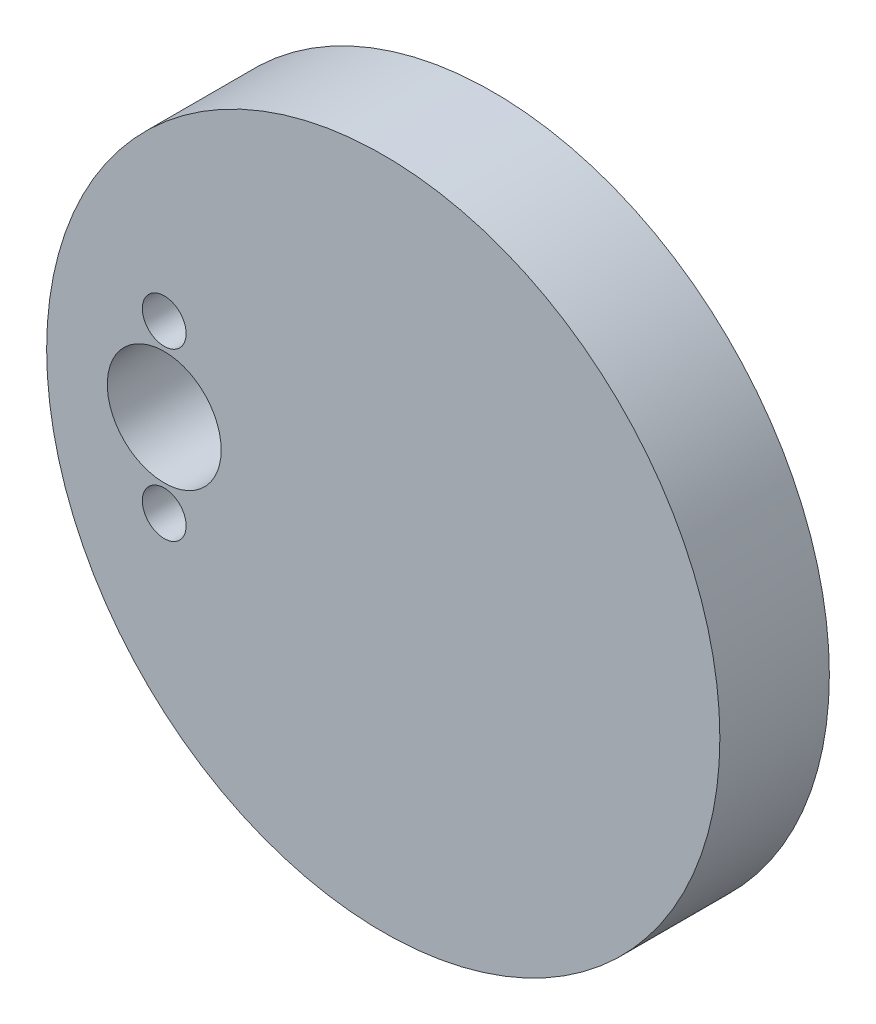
ISO-10303-21;
HEADER;
FILE_DESCRIPTION(('STEP AP214'),'2;1');
FILE_NAME('part.step','',(''),(''),'','','');
FILE_SCHEMA(('AUTOMOTIVE_DESIGN { 1 0 10303 214 1 1 1 1 }'));
ENDSEC;
DATA;
#1=APPLICATION_CONTEXT('core data for automotive mechanical design processes');
#2=APPLICATION_PROTOCOL_DEFINITION('international standard','automotive_design',2000,#1);
#3=PRODUCT_CONTEXT('',#1,'mechanical');
#4=PRODUCT('Part','Part','',(#3));
#5=PRODUCT_RELATED_PRODUCT_CATEGORY('part','',(#4));
#6=PRODUCT_DEFINITION_FORMATION('','',#4);
#7=PRODUCT_DEFINITION_CONTEXT('part definition',#1,'design');
#8=PRODUCT_DEFINITION('design','',#6,#7);
#9=PRODUCT_DEFINITION_SHAPE('','',#8);
#10=(LENGTH_UNIT() NAMED_UNIT(*) SI_UNIT(.MILLI.,.METRE.));
#11=(NAMED_UNIT(*) PLANE_ANGLE_UNIT() SI_UNIT($,.RADIAN.));
#12=(NAMED_UNIT(*) SI_UNIT($,.STERADIAN.) SOLID_ANGLE_UNIT());
#13=UNCERTAINTY_MEASURE_WITH_UNIT(LENGTH_MEASURE(1.E-05),#10,'distance_accuracy_value','');
#14=(GEOMETRIC_REPRESENTATION_CONTEXT(3) GLOBAL_UNCERTAINTY_ASSIGNED_CONTEXT((#13)) GLOBAL_UNIT_ASSIGNED_CONTEXT((#10,
#11,#12)) REPRESENTATION_CONTEXT('',''));
#15=CARTESIAN_POINT('',(0.,0.,0.));
#16=DIRECTION('',(0.,0.,1.));
#17=DIRECTION('',(1.,0.,0.));
#18=AXIS2_PLACEMENT_3D('',#15,#16,#17);
#19=CARTESIAN_POINT('',(0.,0.,6.35));
#20=DIRECTION('',(0.,0.,1.));
#21=DIRECTION('',(1.,0.,0.));
#22=AXIS2_PLACEMENT_3D('',#19,#20,#21);
#23=PLANE('',#22);
#24=CARTESIAN_POINT('',(-25.4,9.652,6.35));
#25=DIRECTION('',(0.,0.,1.));
#26=DIRECTION('',(1.,0.,0.));
#27=AXIS2_PLACEMENT_3D('',#24,#25,#26);
#28=CIRCLE('',#27,2.54);
#29=CARTESIAN_POINT('',(-22.86,9.652,6.35));
#30=VERTEX_POINT('',#29);
#31=EDGE_CURVE('E47',#30,#30,#28,.T.);
#32=ORIENTED_EDGE('',*,*,#31,.F.);
#33=EDGE_LOOP('',(#32));
#34=FACE_BOUND('',#33,.T.);
#35=CARTESIAN_POINT('',(0.,0.,6.35));
#36=DIRECTION('',(0.,0.,1.));
#37=DIRECTION('',(1.,0.,0.));
#38=AXIS2_PLACEMENT_3D('',#35,#36,#37);
#39=CIRCLE('',#38,39.0398);
#40=CARTESIAN_POINT('',(39.0398,0.,6.35));
#41=VERTEX_POINT('',#40);
#42=EDGE_CURVE('E10',#41,#41,#39,.T.);
#43=ORIENTED_EDGE('',*,*,#42,.T.);
#44=EDGE_LOOP('',(#43));
#45=FACE_BOUND('',#44,.T.);
#46=CARTESIAN_POINT('',(-25.4,0.,6.35));
#47=DIRECTION('',(0.,0.,1.));
#48=DIRECTION('',(1.,0.,0.));
#49=AXIS2_PLACEMENT_3D('',#46,#47,#48);
#50=CIRCLE('',#49,6.604);
#51=CARTESIAN_POINT('',(-18.796,0.,6.35));
#52=VERTEX_POINT('',#51);
#53=EDGE_CURVE('E42',#52,#52,#50,.T.);
#54=ORIENTED_EDGE('',*,*,#53,.F.);
#55=EDGE_LOOP('',(#54));
#56=FACE_BOUND('',#55,.T.);
#57=CARTESIAN_POINT('',(-25.4,-9.652,6.35));
#58=DIRECTION('',(0.,0.,1.));
#59=DIRECTION('',(1.,0.,0.));
#60=AXIS2_PLACEMENT_3D('',#57,#58,#59);
#61=CIRCLE('',#60,2.54);
#62=CARTESIAN_POINT('',(-22.86,-9.652,6.35));
#63=VERTEX_POINT('',#62);
#64=EDGE_CURVE('E53',#63,#63,#61,.T.);
#65=ORIENTED_EDGE('',*,*,#64,.F.);
#66=EDGE_LOOP('',(#65));
#67=FACE_BOUND('',#66,.T.);
#68=ADVANCED_FACE('F31',(#34,#45,#56,#67),#23,.T.);
#69=CARTESIAN_POINT('',(0.,0.,-6.35));
#70=DIRECTION('',(0.,0.,1.));
#71=DIRECTION('',(1.,0.,0.));
#72=AXIS2_PLACEMENT_3D('',#69,#70,#71);
#73=PLANE('',#72);
#74=CARTESIAN_POINT('',(0.,0.,-6.35));
#75=DIRECTION('',(0.,0.,1.));
#76=DIRECTION('',(1.,0.,0.));
#77=AXIS2_PLACEMENT_3D('',#74,#75,#76);
#78=CIRCLE('',#77,39.0398);
#79=CARTESIAN_POINT('',(39.0398,0.,-6.35));
#80=VERTEX_POINT('',#79);
#81=EDGE_CURVE('E35',#80,#80,#78,.T.);
#82=ORIENTED_EDGE('',*,*,#81,.F.);
#83=EDGE_LOOP('',(#82));
#84=FACE_BOUND('',#83,.T.);
#85=CARTESIAN_POINT('',(-25.4,0.,-6.35));
#86=DIRECTION('',(0.,0.,1.));
#87=DIRECTION('',(1.,0.,0.));
#88=AXIS2_PLACEMENT_3D('',#85,#86,#87);
#89=CIRCLE('',#88,6.604);
#90=CARTESIAN_POINT('',(-18.796,0.,-6.35));
#91=VERTEX_POINT('',#90);
#92=EDGE_CURVE('E44',#91,#91,#89,.T.);
#93=ORIENTED_EDGE('',*,*,#92,.T.);
#94=EDGE_LOOP('',(#93));
#95=FACE_BOUND('',#94,.T.);
#96=CARTESIAN_POINT('',(-25.4,9.652,-6.35));
#97=DIRECTION('',(0.,0.,1.));
#98=DIRECTION('',(1.,0.,0.));
#99=AXIS2_PLACEMENT_3D('',#96,#97,#98);
#100=CIRCLE('',#99,2.54);
#101=CARTESIAN_POINT('',(-22.86,9.652,-6.35));
#102=VERTEX_POINT('',#101);
#103=EDGE_CURVE('E50',#102,#102,#100,.T.);
#104=ORIENTED_EDGE('',*,*,#103,.T.);
#105=EDGE_LOOP('',(#104));
#106=FACE_BOUND('',#105,.T.);
#107=CARTESIAN_POINT('',(-25.4,-9.652,-6.35));
#108=DIRECTION('',(0.,0.,1.));
#109=DIRECTION('',(1.,0.,0.));
#110=AXIS2_PLACEMENT_3D('',#107,#108,#109);
#111=CIRCLE('',#110,2.54);
#112=CARTESIAN_POINT('',(-22.86,-9.652,-6.35));
#113=VERTEX_POINT('',#112);
#114=EDGE_CURVE('E56',#113,#113,#111,.T.);
#115=ORIENTED_EDGE('',*,*,#114,.T.);
#116=EDGE_LOOP('',(#115));
#117=FACE_BOUND('',#116,.T.);
#118=ADVANCED_FACE('F66',(#84,#95,#106,#117),#73,.F.);
#119=CARTESIAN_POINT('',(0.,0.,6.35));
#120=DIRECTION('',(0.,0.,-1.));
#121=DIRECTION('',(-1.,0.,0.));
#122=AXIS2_PLACEMENT_3D('',#119,#120,#121);
#123=CYLINDRICAL_SURFACE('',#122,39.0398);
#124=ORIENTED_EDGE('',*,*,#42,.F.);
#125=EDGE_LOOP('',(#124));
#126=FACE_BOUND('',#125,.T.);
#127=ORIENTED_EDGE('',*,*,#81,.T.);
#128=EDGE_LOOP('',(#127));
#129=FACE_BOUND('',#128,.T.);
#130=ADVANCED_FACE('F33',(#126,#129),#123,.T.);
#131=CARTESIAN_POINT('',(-25.4,0.,6.35));
#132=DIRECTION('',(0.,0.,-1.));
#133=DIRECTION('',(-1.,0.,0.));
#134=AXIS2_PLACEMENT_3D('',#131,#132,#133);
#135=CYLINDRICAL_SURFACE('',#134,6.604);
#136=ORIENTED_EDGE('',*,*,#53,.T.);
#137=EDGE_LOOP('',(#136));
#138=FACE_BOUND('',#137,.T.);
#139=ORIENTED_EDGE('',*,*,#92,.F.);
#140=EDGE_LOOP('',(#139));
#141=FACE_BOUND('',#140,.T.);
#142=ADVANCED_FACE('F75',(#138,#141),#135,.F.);
#143=CARTESIAN_POINT('',(-25.4,9.652,6.35));
#144=DIRECTION('',(0.,0.,-1.));
#145=DIRECTION('',(-1.,0.,0.));
#146=AXIS2_PLACEMENT_3D('',#143,#144,#145);
#147=CYLINDRICAL_SURFACE('',#146,2.54);
#148=ORIENTED_EDGE('',*,*,#31,.T.);
#149=EDGE_LOOP('',(#148));
#150=FACE_BOUND('',#149,.T.);
#151=ORIENTED_EDGE('',*,*,#103,.F.);
#152=EDGE_LOOP('',(#151));
#153=FACE_BOUND('',#152,.T.);
#154=ADVANCED_FACE('F78',(#150,#153),#147,.F.);
#155=CARTESIAN_POINT('',(-25.4,-9.652,6.35));
#156=DIRECTION('',(0.,0.,-1.));
#157=DIRECTION('',(-1.,0.,0.));
#158=AXIS2_PLACEMENT_3D('',#155,#156,#157);
#159=CYLINDRICAL_SURFACE('',#158,2.54);
#160=ORIENTED_EDGE('',*,*,#64,.T.);
#161=EDGE_LOOP('',(#160));
#162=FACE_BOUND('',#161,.T.);
#163=ORIENTED_EDGE('',*,*,#114,.F.);
#164=EDGE_LOOP('',(#163));
#165=FACE_BOUND('',#164,.T.);
#166=ADVANCED_FACE('F62',(#162,#165),#159,.F.);
#167=CLOSED_SHELL('',(#68,#118,#130,#142,#154,#166));
#168=MANIFOLD_SOLID_BREP('B2',#167);
#169=ADVANCED_BREP_SHAPE_REPRESENTATION('',(#18,#168),#14);
#170=SHAPE_DEFINITION_REPRESENTATION(#9,#169);
ENDSEC;
END-ISO-10303-21;
